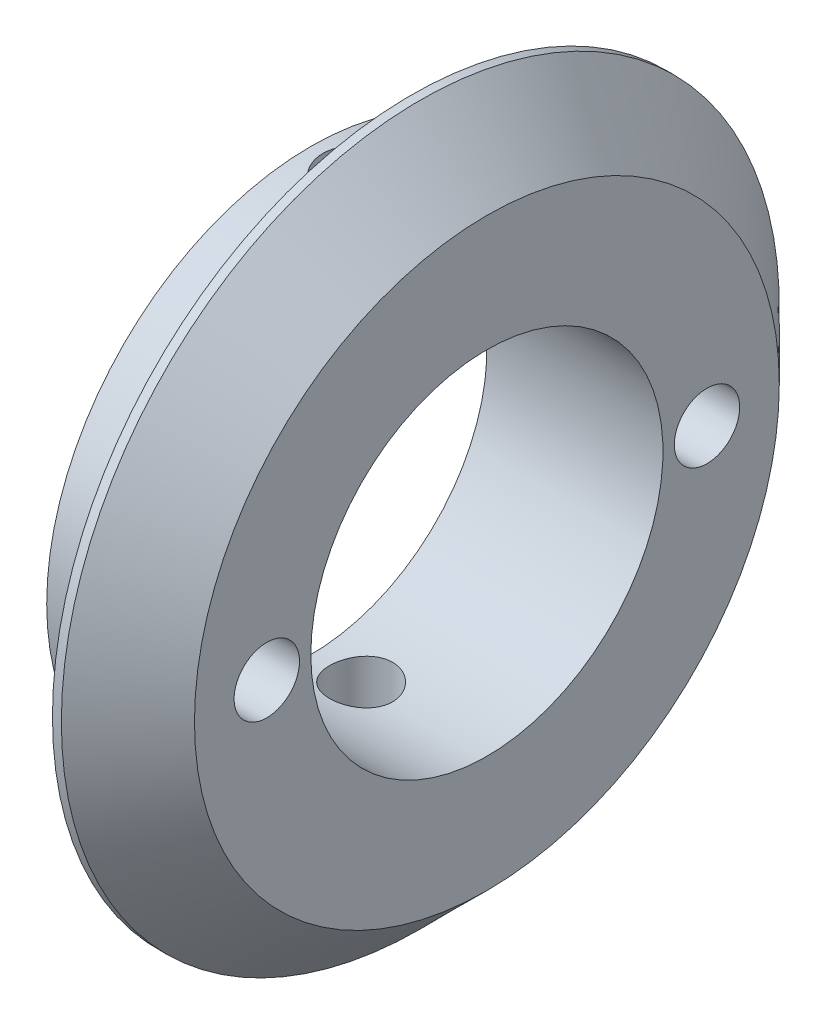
ISO-10303-21;
HEADER;
FILE_DESCRIPTION(('STEP AP214'),'2;1');
FILE_NAME('part.step','',(''),(''),'','','');
FILE_SCHEMA(('AUTOMOTIVE_DESIGN { 1 0 10303 214 1 1 1 1 }'));
ENDSEC;
DATA;
#1=APPLICATION_CONTEXT('core data for automotive mechanical design processes');
#2=APPLICATION_PROTOCOL_DEFINITION('international standard','automotive_design',2000,#1);
#3=PRODUCT_CONTEXT('',#1,'mechanical');
#4=PRODUCT('Part','Part','',(#3));
#5=PRODUCT_RELATED_PRODUCT_CATEGORY('part','',(#4));
#6=PRODUCT_DEFINITION_FORMATION('','',#4);
#7=PRODUCT_DEFINITION_CONTEXT('part definition',#1,'design');
#8=PRODUCT_DEFINITION('design','',#6,#7);
#9=PRODUCT_DEFINITION_SHAPE('','',#8);
#10=(LENGTH_UNIT() NAMED_UNIT(*) SI_UNIT(.MILLI.,.METRE.));
#11=(NAMED_UNIT(*) PLANE_ANGLE_UNIT() SI_UNIT($,.RADIAN.));
#12=(NAMED_UNIT(*) SI_UNIT($,.STERADIAN.) SOLID_ANGLE_UNIT());
#13=UNCERTAINTY_MEASURE_WITH_UNIT(LENGTH_MEASURE(1.E-05),#10,'distance_accuracy_value','');
#14=(GEOMETRIC_REPRESENTATION_CONTEXT(3) GLOBAL_UNCERTAINTY_ASSIGNED_CONTEXT((#13)) GLOBAL_UNIT_ASSIGNED_CONTEXT((#10,
#11,#12)) REPRESENTATION_CONTEXT('',''));
#15=CARTESIAN_POINT('',(0.,0.,0.));
#16=DIRECTION('',(0.,0.,1.));
#17=DIRECTION('',(1.,0.,0.));
#18=AXIS2_PLACEMENT_3D('',#15,#16,#17);
#19=CARTESIAN_POINT('',(3.9619976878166,20.,0.));
#20=DIRECTION('',(0.,1.,0.));
#21=DIRECTION('',(-1.,0.,0.));
#22=AXIS2_PLACEMENT_3D('',#19,#20,#21);
#23=CYLINDRICAL_SURFACE('',#22,3.);
#24=CARTESIAN_POINT('',(6.93633446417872,20.9963491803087,-0.39156184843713));
#25=CARTESIAN_POINT('',(6.9192450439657,20.9939283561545,-0.521374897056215));
#26=CARTESIAN_POINT('',(6.89364712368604,20.9903177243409,-0.650044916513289));
#27=CARTESIAN_POINT('',(6.82588533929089,20.9809611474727,-0.90293604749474));
#28=CARTESIAN_POINT('',(6.78371274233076,20.9752140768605,-1.02715477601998));
#29=CARTESIAN_POINT('',(6.68352675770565,20.961971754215,-1.26902565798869));
#30=CARTESIAN_POINT('',(6.62550292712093,20.9544753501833,-1.38667342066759));
#31=CARTESIAN_POINT('',(6.49460727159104,20.9382401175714,-1.61339170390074));
#32=CARTESIAN_POINT('',(6.42172693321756,20.9295005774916,-1.72245725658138));
#33=CARTESIAN_POINT('',(6.26236201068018,20.9113704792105,-1.93014581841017));
#34=CARTESIAN_POINT('',(6.1758729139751,20.9019797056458,-2.02876534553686));
#35=CARTESIAN_POINT('',(5.99076378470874,20.8831851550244,-2.21387464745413));
#36=CARTESIAN_POINT('',(5.89214358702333,20.8737813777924,-2.30036425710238));
#37=CARTESIAN_POINT('',(5.68445450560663,20.8556028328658,-2.45972958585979));
#38=CARTESIAN_POINT('',(5.57538906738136,20.8468278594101,-2.53260977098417));
#39=CARTESIAN_POINT('',(5.34867109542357,20.830508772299,-2.66350524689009));
#40=CARTESIAN_POINT('',(5.2310235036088,20.8229639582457,-2.72152900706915));
#41=CARTESIAN_POINT('',(4.98915286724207,20.8096248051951,-2.8217148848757));
#42=CARTESIAN_POINT('',(4.86493424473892,20.8038293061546,-2.86388751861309));
#43=CARTESIAN_POINT('',(4.61204303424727,20.7943888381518,-2.9316493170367));
#44=CARTESIAN_POINT('',(4.48337286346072,20.7907427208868,-2.95724733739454));
#45=CARTESIAN_POINT('',(4.2238003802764,20.7858536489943,-2.99141907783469));
#46=CARTESIAN_POINT('',(4.09289903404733,20.7846096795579,-2.9999999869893));
#47=CARTESIAN_POINT('',(3.83109634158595,20.7846096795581,-2.99999998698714));
#48=CARTESIAN_POINT('',(3.70019499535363,20.7858536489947,-2.99141907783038));
#49=CARTESIAN_POINT('',(3.44062251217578,20.7907427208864,-2.95724733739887));
#50=CARTESIAN_POINT('',(3.31195234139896,20.7943888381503,-2.93164931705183));
#51=CARTESIAN_POINT('',(3.05906113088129,20.8038293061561,-2.86388751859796));
#52=CARTESIAN_POINT('',(2.93484250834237,20.8096248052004,-2.8217148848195));
#53=CARTESIAN_POINT('',(2.69297187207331,20.8229639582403,-2.72152900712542));
#54=CARTESIAN_POINT('',(2.57532428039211,20.8305087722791,-2.66350524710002));
#55=CARTESIAN_POINT('',(2.34860630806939,20.84682785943,-2.53260977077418));
#56=CARTESIAN_POINT('',(2.23954086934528,20.8556028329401,-2.45972958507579));
#57=CARTESIAN_POINT('',(2.03185250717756,20.8737813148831,-2.30036480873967));
#58=CARTESIAN_POINT('',(1.93323295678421,20.88318502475,-2.21387584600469));
#59=CARTESIAN_POINT('',(1.74812366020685,20.9019795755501,-2.0287667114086));
#60=CARTESIAN_POINT('',(1.66163391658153,20.9113704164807,-1.93014653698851));
#61=CARTESIAN_POINT('',(1.50226844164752,20.929500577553,-1.72245725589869));
#62=CARTESIAN_POINT('',(1.42938810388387,20.9382401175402,-1.61339170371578));
#63=CARTESIAN_POINT('',(1.29849244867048,20.9544753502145,-1.38667342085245));
#64=CARTESIAN_POINT('',(1.24046861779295,20.9619717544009,-1.26902565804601));
#65=CARTESIAN_POINT('',(1.14028263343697,20.9752140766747,-1.02715477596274));
#66=CARTESIAN_POINT('',(1.09811003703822,20.9809611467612,-0.902936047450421));
#67=CARTESIAN_POINT('',(1.03034825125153,20.9903177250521,-0.650044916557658));
#68=CARTESIAN_POINT('',(1.00475032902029,20.9939283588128,-0.521374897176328));
#69=CARTESIAN_POINT('',(0.97057857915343,20.9987689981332,-0.261802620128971));
#70=CARTESIAN_POINT('',(0.961997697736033,20.9999999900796,-0.130901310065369));
#71=CARTESIAN_POINT('',(0.96199769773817,20.9999999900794,0.130901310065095));
#72=CARTESIAN_POINT('',(0.970578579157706,20.9987689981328,0.261802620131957));
#73=CARTESIAN_POINT('',(1.00475032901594,20.9939283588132,0.521374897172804));
#74=CARTESIAN_POINT('',(1.03034825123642,20.9903177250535,0.650044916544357));
#75=CARTESIAN_POINT('',(1.09811003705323,20.9809611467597,0.902936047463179));
#76=CARTESIAN_POINT('',(1.14028263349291,20.9752140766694,1.02715477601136));
#77=CARTESIAN_POINT('',(1.24046861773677,20.9619717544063,1.26902565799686));
#78=CARTESIAN_POINT('',(1.29849244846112,20.9544753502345,1.38667342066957));
#79=CARTESIAN_POINT('',(1.42938810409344,20.9382401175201,1.61339170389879));
#80=CARTESIAN_POINT('',(1.50226844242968,20.929500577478,1.72245725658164));
#81=CARTESIAN_POINT('',(1.66163336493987,20.9113704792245,1.93014581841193));
#82=CARTESIAN_POINT('',(1.74812246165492,20.9019797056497,2.02876534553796));
#83=CARTESIAN_POINT('',(1.93323159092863,20.8831851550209,2.21387464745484));
#84=CARTESIAN_POINT('',(2.03185178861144,20.8737813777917,2.30036425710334));
#85=CARTESIAN_POINT('',(2.23954087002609,20.855602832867,2.45972958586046));
#86=CARTESIAN_POINT('',(2.34860630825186,20.8468278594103,2.53260977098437));
#87=CARTESIAN_POINT('',(2.57532428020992,20.8305087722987,2.66350524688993));
#88=CARTESIAN_POINT('',(2.69297187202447,20.8229639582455,2.72152900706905));
#89=CARTESIAN_POINT('',(2.93484250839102,20.8096248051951,2.82171488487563));
#90=CARTESIAN_POINT('',(3.05906113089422,20.8038293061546,2.86388751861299));
#91=CARTESIAN_POINT('',(3.31195234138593,20.7943888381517,2.93164931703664));
#92=CARTESIAN_POINT('',(3.44062251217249,20.7907427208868,2.95724733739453));
#93=CARTESIAN_POINT('',(3.70019499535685,20.7858536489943,2.99141907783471));
#94=CARTESIAN_POINT('',(3.83109634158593,20.7846096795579,2.9999999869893));
#95=CARTESIAN_POINT('',(4.09289903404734,20.7846096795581,2.99999998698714));
#96=CARTESIAN_POINT('',(4.22380038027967,20.7858536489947,2.99141907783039));
#97=CARTESIAN_POINT('',(4.48337286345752,20.7907427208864,2.95724733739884));
#98=CARTESIAN_POINT('',(4.61204303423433,20.7943888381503,2.93164931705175));
#99=CARTESIAN_POINT('',(4.86493424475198,20.803829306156,2.86388751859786));
#100=CARTESIAN_POINT('',(4.98915286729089,20.8096248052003,2.82171488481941));
#101=CARTESIAN_POINT('',(5.2310235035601,20.8229639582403,2.72152900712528));
#102=CARTESIAN_POINT('',(5.34867109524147,20.8305087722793,2.66350524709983));
#103=CARTESIAN_POINT('',(5.57538906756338,20.8468278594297,2.5326097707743));
#104=CARTESIAN_POINT('',(5.68445450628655,20.8556028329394,2.45972958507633));
#105=CARTESIAN_POINT('',(5.8921428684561,20.8737813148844,2.30036480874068));
#106=CARTESIAN_POINT('',(5.99076241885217,20.8831850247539,2.21387584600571));
#107=CARTESIAN_POINT('',(6.17587171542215,20.9019795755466,2.02876671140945));
#108=CARTESIAN_POINT('',(6.26236145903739,20.9113704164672,1.9301465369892));
#109=CARTESIAN_POINT('',(6.42172693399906,20.9295005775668,1.72245725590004));
#110=CARTESIAN_POINT('',(6.49460727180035,20.9382401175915,1.61339170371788));
#111=CARTESIAN_POINT('',(6.62550292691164,20.9544753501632,1.38667342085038));
#112=CARTESIAN_POINT('',(6.68352675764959,20.9619717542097,1.26902565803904));
#113=CARTESIAN_POINT('',(6.78371274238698,20.9752140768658,1.02715477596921));
#114=CARTESIAN_POINT('',(6.82588533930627,20.980961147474,0.902936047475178));
#115=CARTESIAN_POINT('',(6.89364712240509,20.9903177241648,0.650044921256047));
#116=CARTESIAN_POINT('',(6.9192450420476,20.9939283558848,0.521374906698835));
#117=CARTESIAN_POINT('',(6.95341679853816,20.9987690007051,0.261802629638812));
#118=CARTESIAN_POINT('',(6.96199768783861,21.0000000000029,0.13090131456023));
#119=CARTESIAN_POINT('',(6.96199768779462,20.9999999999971,-0.130901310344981));
#120=CARTESIAN_POINT('',(6.95341679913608,20.9987690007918,-0.26180262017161));
#121=CARTESIAN_POINT('',(6.93633446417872,20.9963491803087,-0.39156184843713));
#122=B_SPLINE_CURVE_WITH_KNOTS('',3,(#24,#25,#26,#27,#28,#29,#30,#31,#32,#33,#34,#35,#36,#37,
#38,#39,#40,#41,#42,#43,#44,#45,#46,#47,#48,#49,#50,#51,#52,#53,#54,#55,#56,#57,#58,#59,#60,#61,
#62,#63,#64,#65,#66,#67,#68,#69,#70,#71,#72,#73,#74,#75,#76,#77,#78,#79,#80,#81,#82,#83,#84,#85,
#86,#87,#88,#89,#90,#91,#92,#93,#94,#95,#96,#97,#98,#99,#100,#101,#102,#103,#104,#105,#106,#107,
#108,#109,#110,#111,#112,#113,#114,#115,#116,#117,#118,#119,#120,#121),.UNSPECIFIED.,.T.,.F.,(4,
2,2,2,2,2,2,2,2,2,2,2,2,2,2,2,2,2,2,2,2,2,2,2,2,2,2,2,2,2,2,2,2,2,2,2,2,2,2,2,2,2,2,2,2,2,2,2,
4),(0.,0.392581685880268,0.785370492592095,1.1784186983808,1.57169277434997,1.96509753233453,
2.35850764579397,2.7517884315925,3.14484451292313,3.53763936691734,3.93022418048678,
4.32264310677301,4.71506203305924,5.10764684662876,5.50044170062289,5.89349778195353,
6.28677856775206,6.68018596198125,7.07359343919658,7.46686751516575,7.85991572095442,
8.25270452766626,8.64528621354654,9.03770513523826,9.43012405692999,9.82270574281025,
10.2154945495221,10.6085427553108,11.0018168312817,11.3952215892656,11.7886317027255,
12.1819124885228,12.5749685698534,12.9677634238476,13.3603482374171,13.7527671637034,
14.1451860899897,14.5377709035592,14.9305657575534,15.323621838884,15.7169026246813,
16.1103100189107,16.5037174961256,16.8969915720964,17.2900397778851,17.682828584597,
18.0754102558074,18.467829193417,18.8602481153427),.UNSPECIFIED.);
#123=CARTESIAN_POINT('',(6.93633446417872,20.9963491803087,-0.39156184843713));
#124=VERTEX_POINT('',#123);
#125=EDGE_CURVE('E71',#124,#124,#122,.T.);
#126=ORIENTED_EDGE('',*,*,#125,.T.);
#127=EDGE_LOOP('',(#126));
#128=FACE_BOUND('',#127,.T.);
#129=CARTESIAN_POINT('',(3.9619976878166,20.,0.));
#130=DIRECTION('',(0.,1.,0.));
#131=DIRECTION('',(-1.,0.,0.));
#132=AXIS2_PLACEMENT_3D('',#129,#130,#131);
#133=CIRCLE('',#132,3.);
#134=CARTESIAN_POINT('',(0.961997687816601,20.,0.));
#135=VERTEX_POINT('',#134);
#136=EDGE_CURVE('E19',#135,#135,#133,.F.);
#137=ORIENTED_EDGE('',*,*,#136,.T.);
#138=EDGE_LOOP('',(#137));
#139=FACE_BOUND('',#138,.T.);
#140=ADVANCED_FACE('F15',(#128,#139),#23,.F.);
#141=CARTESIAN_POINT('',(0.90199768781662,20.,3.));
#142=DIRECTION('',(0.,-1.,0.));
#143=DIRECTION('',(0.,0.,-1.));
#144=AXIS2_PLACEMENT_3D('',#141,#142,#143);
#145=PLANE('',#144);
#146=CARTESIAN_POINT('',(4.,20.,0.));
#147=DIRECTION('',(0.,1.,0.));
#148=DIRECTION('',(0.,0.,1.));
#149=AXIS2_PLACEMENT_3D('',#146,#147,#148);
#150=CIRCLE('',#149,2.5);
#151=CARTESIAN_POINT('',(4.,20.,2.5));
#152=VERTEX_POINT('',#151);
#153=EDGE_CURVE('E157',#152,#152,#150,.T.);
#154=ORIENTED_EDGE('',*,*,#153,.F.);
#155=EDGE_LOOP('',(#154));
#156=FACE_BOUND('',#155,.T.);
#157=ORIENTED_EDGE('',*,*,#136,.F.);
#158=EDGE_LOOP('',(#157));
#159=FACE_BOUND('',#158,.T.);
#160=ADVANCED_FACE('F48',(#156,#159),#145,.F.);
#161=CARTESIAN_POINT('',(4.,13.7376271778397,0.));
#162=DIRECTION('',(0.,1.,0.));
#163=DIRECTION('',(0.,0.,1.));
#164=AXIS2_PLACEMENT_3D('',#161,#162,#163);
#165=CYLINDRICAL_SURFACE('',#164,2.5);
#166=ORIENTED_EDGE('',*,*,#153,.T.);
#167=EDGE_LOOP('',(#166));
#168=FACE_BOUND('',#167,.T.);
#169=CARTESIAN_POINT('',(4.00000016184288,13.7749773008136,2.49999998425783));
#170=CARTESIAN_POINT('',(4.10908546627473,13.7749773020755,2.49999997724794));
#171=CARTESIAN_POINT('',(4.21817076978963,13.7762809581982,2.49284860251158));
#172=CARTESIAN_POINT('',(4.43448750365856,13.781403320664,2.46437210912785));
#173=CARTESIAN_POINT('',(4.54171764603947,13.7852237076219,2.44303751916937));
#174=CARTESIAN_POINT('',(4.75246644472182,13.7951119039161,2.38656780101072));
#175=CARTESIAN_POINT('',(4.85598189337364,13.8011816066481,2.35142104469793));
#176=CARTESIAN_POINT('',(5.05754062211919,13.8151463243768,2.26793297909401));
#177=CARTESIAN_POINT('',(5.15557806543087,13.823043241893,2.21957790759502));
#178=CARTESIAN_POINT('',(5.34450646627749,13.8401167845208,2.11050030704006));
#179=CARTESIAN_POINT('',(5.43539094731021,13.8492945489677,2.04976674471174));
#180=CARTESIAN_POINT('',(5.60845991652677,13.8682996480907,1.91696641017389));
#181=CARTESIAN_POINT('',(5.69063998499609,13.8781273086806,1.84489392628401));
#182=CARTESIAN_POINT('',(5.84489264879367,13.897761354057,1.6906412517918));
#183=CARTESIAN_POINT('',(5.91696541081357,13.9075677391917,1.60846122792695));
#184=CARTESIAN_POINT('',(6.04976604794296,13.9264933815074,1.43539184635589));
#185=CARTESIAN_POINT('',(6.11049992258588,13.9356130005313,1.34450713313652));
#186=CARTESIAN_POINT('',(6.21957789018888,13.9525488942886,1.15557809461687));
#187=CARTESIAN_POINT('',(6.26793310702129,13.9603663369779,1.05754029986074));
#188=CARTESIAN_POINT('',(6.35142139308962,13.9741720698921,0.855981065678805));
#189=CARTESIAN_POINT('',(6.38656807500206,13.9801622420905,0.752465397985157));
#190=CARTESIAN_POINT('',(6.44303776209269,13.989912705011,0.541716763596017));
#191=CARTESIAN_POINT('',(6.46437214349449,13.9936748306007,0.434486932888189));
#192=CARTESIAN_POINT('',(6.49284866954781,13.9987176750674,0.218170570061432));
#193=CARTESIAN_POINT('',(6.49999999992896,13.9999999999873,0.109085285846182));
#194=CARTESIAN_POINT('',(6.50000000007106,14.0000000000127,-0.10908528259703));
#195=CARTESIAN_POINT('',(6.4928486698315,13.9987176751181,-0.218170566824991));
#196=CARTESIAN_POINT('',(6.46437214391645,13.993674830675,-0.434486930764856));
#197=CARTESIAN_POINT('',(6.44303776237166,13.9899127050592,-0.541716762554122));
#198=CARTESIAN_POINT('',(6.38656807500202,13.9801622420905,-0.752465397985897));
#199=CARTESIAN_POINT('',(6.35142139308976,13.9741720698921,-0.855981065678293));
#200=CARTESIAN_POINT('',(6.26793310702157,13.9603663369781,-1.05754029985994));
#201=CARTESIAN_POINT('',(6.21957789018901,13.952548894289,-1.15557809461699));
#202=CARTESIAN_POINT('',(6.1104999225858,13.935613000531,-1.34450713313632));
#203=CARTESIAN_POINT('',(6.04976604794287,13.9264933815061,-1.43539184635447));
#204=CARTESIAN_POINT('',(5.91696541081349,13.907567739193,-1.6084612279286));
#205=CARTESIAN_POINT('',(5.8448926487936,13.8977613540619,-1.69064125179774));
#206=CARTESIAN_POINT('',(5.69063998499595,13.8781273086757,-1.84489392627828));
#207=CARTESIAN_POINT('',(5.60845991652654,13.8682996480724,-1.91696641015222));
#208=CARTESIAN_POINT('',(5.43539094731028,13.849294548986,-2.04976674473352));
#209=CARTESIAN_POINT('',(5.34450646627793,13.840116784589,-2.1105003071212));
#210=CARTESIAN_POINT('',(5.15557806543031,13.8230432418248,-2.21957790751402));
#211=CARTESIAN_POINT('',(5.05754062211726,13.8151463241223,-2.26793297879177));
#212=CARTESIAN_POINT('',(4.85598189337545,13.8011816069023,-2.35142104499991));
#213=CARTESIAN_POINT('',(4.75246644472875,13.7951119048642,-2.38656780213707));
#214=CARTESIAN_POINT('',(4.54171764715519,13.7852237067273,-2.44303751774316));
#215=CARTESIAN_POINT('',(4.4344875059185,13.7814033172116,-2.46437210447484));
#216=CARTESIAN_POINT('',(4.2181707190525,13.7762809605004,-2.49284861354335));
#217=CARTESIAN_POINT('',(4.1090853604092,13.7749773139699,-2.49999999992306));
#218=CARTESIAN_POINT('',(3.8909146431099,13.7749773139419,-2.50000000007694));
#219=CARTESIAN_POINT('',(3.7818292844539,13.7762809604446,-2.49284861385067));
#220=CARTESIAN_POINT('',(3.56551249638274,13.7814033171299,-2.46437210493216));
#221=CARTESIAN_POINT('',(3.45828235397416,13.7852237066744,-2.44303751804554));
#222=CARTESIAN_POINT('',(3.2475335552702,13.7951119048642,-2.38656780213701));
#223=CARTESIAN_POINT('',(3.14401810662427,13.8011816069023,-2.3514210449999));
#224=CARTESIAN_POINT('',(2.94245937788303,13.8151463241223,-2.26793297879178));
#225=CARTESIAN_POINT('',(2.84442193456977,13.8230432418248,-2.21957790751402));
#226=CARTESIAN_POINT('',(2.65549353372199,13.840116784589,-2.1105003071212));
#227=CARTESIAN_POINT('',(2.5646090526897,13.849294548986,-2.04976674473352));
#228=CARTESIAN_POINT('',(2.39154008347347,13.8682996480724,-1.91696641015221));
#229=CARTESIAN_POINT('',(2.30936001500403,13.8781273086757,-1.84489392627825));
#230=CARTESIAN_POINT('',(2.1551073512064,13.8977613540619,-1.69064125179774));
#231=CARTESIAN_POINT('',(2.08303458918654,13.907567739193,-1.60846122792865));
#232=CARTESIAN_POINT('',(1.95023395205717,13.9264933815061,-1.43539184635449));
#233=CARTESIAN_POINT('',(1.88950007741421,13.935613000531,-1.34450713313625));
#234=CARTESIAN_POINT('',(1.78042210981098,13.952548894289,-1.15557809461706));
#235=CARTESIAN_POINT('',(1.73206689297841,13.9603663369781,-1.05754029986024));
#236=CARTESIAN_POINT('',(1.64857860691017,13.9741720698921,-0.855981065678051));
#237=CARTESIAN_POINT('',(1.61343192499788,13.9801622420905,-0.752465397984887));
#238=CARTESIAN_POINT('',(1.55696223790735,13.9899127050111,-0.541716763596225));
#239=CARTESIAN_POINT('',(1.53562785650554,13.9936748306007,-0.434486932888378));
#240=CARTESIAN_POINT('',(1.50715133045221,13.9987176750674,-0.218170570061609));
#241=CARTESIAN_POINT('',(1.50000000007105,13.9999999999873,-0.109085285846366));
#242=CARTESIAN_POINT('',(1.49999999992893,14.0000000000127,0.109085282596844));
#243=CARTESIAN_POINT('',(1.50715133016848,13.9987176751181,0.218170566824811));
#244=CARTESIAN_POINT('',(1.53562785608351,13.993674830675,0.434486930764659));
#245=CARTESIAN_POINT('',(1.5569622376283,13.9899127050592,0.541716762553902));
#246=CARTESIAN_POINT('',(1.61343192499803,13.9801622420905,0.752465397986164));
#247=CARTESIAN_POINT('',(1.64857860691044,13.9741720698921,0.855981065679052));
#248=CARTESIAN_POINT('',(1.73206689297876,13.9603663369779,1.05754029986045));
#249=CARTESIAN_POINT('',(1.7804221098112,13.9525488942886,1.15557809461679));
#250=CARTESIAN_POINT('',(1.88950007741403,13.9356130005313,1.34450713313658));
#251=CARTESIAN_POINT('',(1.95023395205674,13.9264933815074,1.43539184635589));
#252=CARTESIAN_POINT('',(2.0830345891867,13.9075677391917,1.60846122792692));
#253=CARTESIAN_POINT('',(2.15510735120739,13.897761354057,1.6906412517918));
#254=CARTESIAN_POINT('',(2.30936001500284,13.8781273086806,1.84489392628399));
#255=CARTESIAN_POINT('',(2.39154008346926,13.8682996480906,1.91696641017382));
#256=CARTESIAN_POINT('',(2.56460905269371,13.8492945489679,2.04976674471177));
#257=CARTESIAN_POINT('',(2.65549353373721,13.8401167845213,2.11050030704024));
#258=CARTESIAN_POINT('',(2.84442193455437,13.8230432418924,2.2195779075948));
#259=CARTESIAN_POINT('',(2.94245937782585,13.8151463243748,2.26793297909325));
#260=CARTESIAN_POINT('',(3.1440181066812,13.8011816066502,2.35142104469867));
#261=CARTESIAN_POINT('',(3.24753355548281,13.7951119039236,2.3865678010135));
#262=CARTESIAN_POINT('',(3.45828222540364,13.7852237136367,2.44303748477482));
#263=CARTESIAN_POINT('',(3.56551223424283,13.781403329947,2.46437205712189));
#264=CARTESIAN_POINT('',(3.78182907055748,13.776280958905,2.49284859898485));
#265=CARTESIAN_POINT('',(3.89091461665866,13.7749772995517,2.49999999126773));
#266=CARTESIAN_POINT('',(4.00000016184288,13.7749773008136,2.49999998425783));
#267=B_SPLINE_CURVE_WITH_KNOTS('',3,(#169,#170,#171,#172,#173,#174,#175,#176,#177,#178,#179,
#180,#181,#182,#183,#184,#185,#186,#187,#188,#189,#190,#191,#192,#193,#194,#195,#196,#197,#198,
#199,#200,#201,#202,#203,#204,#205,#206,#207,#208,#209,#210,#211,#212,#213,#214,#215,#216,#217,
#218,#219,#220,#221,#222,#223,#224,#225,#226,#227,#228,#229,#230,#231,#232,#233,#234,#235,#236,
#237,#238,#239,#240,#241,#242,#243,#244,#245,#246,#247,#248,#249,#250,#251,#252,#253,#254,#255,
#256,#257,#258,#259,#260,#261,#262,#263,#264,#265,#266),.UNSPECIFIED.,.T.,.F.,(4,2,2,2,2,2,2,2,
2,2,2,2,2,2,2,2,2,2,2,2,2,2,2,2,2,2,2,2,2,2,2,2,2,2,2,2,2,2,2,2,2,2,2,2,2,2,2,2,4),(0.,
0.327015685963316,0.654249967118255,0.981760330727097,1.30961324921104,1.63775967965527,
1.96607193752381,2.29437878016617,2.62251141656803,2.95034813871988,3.27784606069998,
3.60507390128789,3.93208974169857,4.25910558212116,4.58633342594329,4.91383134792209,
5.24166807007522,5.56980070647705,5.89810754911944,6.22641980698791,6.55456623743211,
6.88241915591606,7.20992951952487,7.53716379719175,7.86417964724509,8.19119549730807,
8.51842977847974,8.8459401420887,9.17379306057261,9.50193949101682,9.83025174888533,
10.1585585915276,10.4866912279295,10.8145279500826,11.1420258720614,11.4692537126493,
11.79626955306,12.1232853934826,12.4505132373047,12.7780111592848,13.1058478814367,
13.4339805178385,13.7622873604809,14.0905996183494,14.4187460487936,14.7465989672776,
15.0741093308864,15.4013432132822,15.7283596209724),.UNSPECIFIED.);
#268=CARTESIAN_POINT('',(4.00000016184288,13.7749773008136,2.49999998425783));
#269=VERTEX_POINT('',#268);
#270=EDGE_CURVE('E10',#269,#269,#267,.T.);
#271=ORIENTED_EDGE('',*,*,#270,.F.);
#272=EDGE_LOOP('',(#271));
#273=FACE_BOUND('',#272,.T.);
#274=ADVANCED_FACE('F42',(#168,#273),#165,.F.);
#275=CARTESIAN_POINT('',(8.,28.542893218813,-28.542893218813));
#276=DIRECTION('',(-1.,0.,0.));
#277=DIRECTION('',(0.,-1.,0.));
#278=AXIS2_PLACEMENT_3D('',#275,#276,#277);
#279=PLANE('',#278);
#280=CARTESIAN_POINT('',(8.,0.,0.));
#281=DIRECTION('',(-1.,0.,0.));
#282=DIRECTION('',(0.,0.,1.));
#283=AXIS2_PLACEMENT_3D('',#280,#281,#282);
#284=CIRCLE('',#283,21.);
#285=CARTESIAN_POINT('',(8.,0.,21.));
#286=VERTEX_POINT('',#285);
#287=EDGE_CURVE('E156',#286,#286,#284,.F.);
#288=ORIENTED_EDGE('',*,*,#287,.T.);
#289=EDGE_LOOP('',(#288));
#290=FACE_BOUND('',#289,.T.);
#291=CARTESIAN_POINT('',(8.,0.,0.));
#292=DIRECTION('',(-1.,0.,0.));
#293=DIRECTION('',(0.,0.,1.));
#294=AXIS2_PLACEMENT_3D('',#291,#292,#293);
#295=CIRCLE('',#294,28.542893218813);
#296=CARTESIAN_POINT('',(8.,0.,28.542893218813));
#297=VERTEX_POINT('',#296);
#298=EDGE_CURVE('E154',#297,#297,#295,.T.);
#299=ORIENTED_EDGE('',*,*,#298,.T.);
#300=EDGE_LOOP('',(#299));
#301=FACE_BOUND('',#300,.T.);
#302=ADVANCED_FACE('F47',(#290,#301),#279,.T.);
#303=CARTESIAN_POINT('',(8.7071067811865,0.,0.));
#304=DIRECTION('',(-1.,0.,0.));
#305=DIRECTION('',(0.,0.,1.));
#306=AXIS2_PLACEMENT_3D('',#303,#304,#305);
#307=CYLINDRICAL_SURFACE('',#306,28.542893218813);
#308=CARTESIAN_POINT('',(8.7071067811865,0.,0.));
#309=DIRECTION('',(-1.,0.,0.));
#310=DIRECTION('',(0.,-1.,0.));
#311=AXIS2_PLACEMENT_3D('',#308,#309,#310);
#312=CIRCLE('',#311,28.542893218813);
#313=CARTESIAN_POINT('',(8.7071067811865,-28.542893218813,0.));
#314=VERTEX_POINT('',#313);
#315=EDGE_CURVE('E76',#314,#314,#312,.T.);
#316=ORIENTED_EDGE('',*,*,#315,.T.);
#317=EDGE_LOOP('',(#316));
#318=FACE_BOUND('',#317,.T.);
#319=ORIENTED_EDGE('',*,*,#298,.F.);
#320=EDGE_LOOP('',(#319));
#321=FACE_BOUND('',#320,.T.);
#322=ADVANCED_FACE('F51',(#318,#321),#307,.T.);
#323=CARTESIAN_POINT('',(1.,-2.6,20.1));
#324=DIRECTION('',(-1.,0.,0.));
#325=DIRECTION('',(0.,1.,0.));
#326=AXIS2_PLACEMENT_3D('',#323,#324,#325);
#327=PLANE('',#326);
#328=CARTESIAN_POINT('',(1.,0.,17.5));
#329=DIRECTION('',(1.,0.,0.));
#330=DIRECTION('',(0.,0.,-1.));
#331=AXIS2_PLACEMENT_3D('',#328,#329,#330);
#332=CIRCLE('',#331,2.6);
#333=CARTESIAN_POINT('',(1.,0.,14.9));
#334=VERTEX_POINT('',#333);
#335=EDGE_CURVE('E79',#334,#334,#332,.F.);
#336=ORIENTED_EDGE('',*,*,#335,.F.);
#337=EDGE_LOOP('',(#336));
#338=FACE_BOUND('',#337,.T.);
#339=ADVANCED_FACE('F54',(#338),#327,.F.);
#340=CARTESIAN_POINT('',(1.,-2.6,-14.9));
#341=DIRECTION('',(-1.,0.,0.));
#342=DIRECTION('',(0.,1.,0.));
#343=AXIS2_PLACEMENT_3D('',#340,#341,#342);
#344=PLANE('',#343);
#345=CARTESIAN_POINT('',(1.,0.,-17.5));
#346=DIRECTION('',(1.,0.,0.));
#347=DIRECTION('',(0.,0.,-1.));
#348=AXIS2_PLACEMENT_3D('',#345,#346,#347);
#349=CIRCLE('',#348,2.6);
#350=CARTESIAN_POINT('',(1.,0.,-20.1));
#351=VERTEX_POINT('',#350);
#352=EDGE_CURVE('E82',#351,#351,#349,.F.);
#353=ORIENTED_EDGE('',*,*,#352,.F.);
#354=EDGE_LOOP('',(#353));
#355=FACE_BOUND('',#354,.T.);
#356=ADVANCED_FACE('F61',(#355),#344,.F.);
#357=CARTESIAN_POINT('',(8.,0.,0.));
#358=DIRECTION('',(-1.,0.,0.));
#359=DIRECTION('',(0.,0.,1.));
#360=AXIS2_PLACEMENT_3D('',#357,#358,#359);
#361=CYLINDRICAL_SURFACE('',#360,21.);
#362=CARTESIAN_POINT('',(1.52138657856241,-20.9974647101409,-0.326305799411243));
#363=CARTESIAN_POINT('',(1.53562682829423,-20.9957837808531,-0.434474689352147));
#364=CARTESIAN_POINT('',(1.55695689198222,-20.993276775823,-0.54169696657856));
#365=CARTESIAN_POINT('',(1.61342414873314,-20.9867806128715,-0.752436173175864));
#366=CARTESIAN_POINT('',(1.64856640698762,-20.9827909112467,-0.85595172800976));
#367=CARTESIAN_POINT('',(1.73205468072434,-20.9735990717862,-1.05751066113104));
#368=CARTESIAN_POINT('',(1.78040673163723,-20.9683963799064,-1.15555151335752));
#369=CARTESIAN_POINT('',(1.88948723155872,-20.9571306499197,-1.34448478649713));
#370=CARTESIAN_POINT('',(1.95022058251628,-20.9510672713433,-1.4353743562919));
#371=CARTESIAN_POINT('',(2.08302696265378,-20.9384913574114,-1.60845129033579));
#372=CARTESIAN_POINT('',(2.15510268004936,-20.9319787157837,-1.69063658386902));
#373=CARTESIAN_POINT('',(2.30936305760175,-20.9189472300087,-1.84489696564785));
#374=CARTESIAN_POINT('',(2.39154767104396,-20.9124283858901,-1.91697210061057));
#375=CARTESIAN_POINT('',(2.56462403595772,-20.8998292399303,-2.04977832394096));
#376=CARTESIAN_POINT('',(2.6555138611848,-20.8937488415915,-2.11051191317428));
#377=CARTESIAN_POINT('',(2.84444740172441,-20.8824428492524,-2.21959271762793));
#378=CARTESIAN_POINT('',(2.94248825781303,-20.8772169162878,-2.2679448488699));
#379=CARTESIAN_POINT('',(3.14406454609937,-20.8679777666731,-2.35144035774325));
#380=CARTESIAN_POINT('',(3.24759838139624,-20.8639641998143,-2.38658755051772));
#381=CARTESIAN_POINT('',(3.45832844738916,-20.85742857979,-2.44304735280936));
#382=CARTESIAN_POINT('',(3.56552163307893,-20.8549053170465,-2.46437118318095));
#383=CARTESIAN_POINT('',(3.78180966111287,-20.8515206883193,-2.4928480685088));
#384=CARTESIAN_POINT('',(3.89090465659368,-20.8506594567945,-2.49999997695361));
#385=CARTESIAN_POINT('',(4.10909464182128,-20.850659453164,-2.50000000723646));
#386=CARTESIAN_POINT('',(4.21818963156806,-20.8515206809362,-2.49284813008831));
#387=CARTESIAN_POINT('',(4.43447763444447,-20.8549053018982,-2.46437131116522));
#388=CARTESIAN_POINT('',(4.54167080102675,-20.8574285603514,-2.44304751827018));
#389=CARTESIAN_POINT('',(4.7524008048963,-20.8639641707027,-2.38658780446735));
#390=CARTESIAN_POINT('',(4.85593459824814,-20.8679777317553,-2.35144066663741));
#391=CARTESIAN_POINT('',(5.0575107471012,-20.8772168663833,-2.2679453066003));
#392=CARTESIAN_POINT('',(5.15555150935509,-20.8824427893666,-2.21959327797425));
#393=CARTESIAN_POINT('',(5.3444846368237,-20.893748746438,-2.11051284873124));
#394=CARTESIAN_POINT('',(5.43537416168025,-20.8998291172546,-2.04977956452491));
#395=CARTESIAN_POINT('',(5.60845102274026,-20.9124282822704,-1.91697324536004));
#396=CARTESIAN_POINT('',(5.69063633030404,-20.9189471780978,-1.84489757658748));
#397=CARTESIAN_POINT('',(5.84489672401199,-20.9319786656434,-1.69063718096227));
#398=CARTESIAN_POINT('',(5.91697192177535,-20.9384912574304,-1.60845256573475));
#399=CARTESIAN_POINT('',(6.04977820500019,-20.9510671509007,-1.43537611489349));
#400=CARTESIAN_POINT('',(6.11051184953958,-20.9571305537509,-1.34448625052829));
#401=CARTESIAN_POINT('',(6.21959271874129,-20.9683963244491,-1.1555525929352));
#402=CARTESIAN_POINT('',(6.2679448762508,-20.973599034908,-1.0575116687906));
#403=CARTESIAN_POINT('',(6.35144033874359,-20.9827916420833,-0.855935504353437));
#404=CARTESIAN_POINT('',(6.38658745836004,-20.9867818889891,-0.752401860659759));
#405=CARTESIAN_POINT('',(6.44304762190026,-20.9932772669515,-0.54167073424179));
#406=CARTESIAN_POINT('',(6.46437163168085,-20.995783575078,-0.434476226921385));
#407=CARTESIAN_POINT('',(6.49284824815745,-20.9991449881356,-0.218187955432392));
#408=CARTESIAN_POINT('',(6.49999997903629,-20.9999999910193,-0.109094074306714));
#409=CARTESIAN_POINT('',(6.50000001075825,-20.9999999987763,0.109083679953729));
#410=CARTESIAN_POINT('',(6.49284961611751,-20.9991451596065,0.21816755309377));
#411=CARTESIAN_POINT('',(6.4643732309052,-20.9957837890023,0.434474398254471));
#412=CARTESIAN_POINT('',(6.44304314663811,-20.9932767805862,0.541696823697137));
#413=CARTESIAN_POINT('',(6.3865758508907,-20.986780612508,0.752436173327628));
#414=CARTESIAN_POINT('',(6.35143359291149,-20.9827909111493,0.85595172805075));
#415=CARTESIAN_POINT('',(6.26794531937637,-20.9735990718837,1.05751066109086));
#416=CARTESIAN_POINT('',(6.21959326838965,-20.9683963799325,1.155551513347));
#417=CARTESIAN_POINT('',(6.1105127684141,-20.9571306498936,1.34448478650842));
#418=CARTESIAN_POINT('',(6.04977941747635,-20.9510672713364,1.43537435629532));
#419=CARTESIAN_POINT('',(5.91697303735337,-20.9384913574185,1.6084512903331));
#420=CARTESIAN_POINT('',(5.84489731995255,-20.9319787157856,1.69063658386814));
#421=CARTESIAN_POINT('',(5.69063694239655,-20.9189472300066,1.84489696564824));
#422=CARTESIAN_POINT('',(5.60845232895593,-20.9124283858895,1.91697210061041));
#423=CARTESIAN_POINT('',(5.43537596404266,-20.8998292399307,2.04977832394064));
#424=CARTESIAN_POINT('',(5.34448613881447,-20.8937488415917,2.11051191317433));
#425=CARTESIAN_POINT('',(5.15555259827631,-20.8824428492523,2.21959271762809));
#426=CARTESIAN_POINT('',(5.05751174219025,-20.8772169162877,2.26794484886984));
#427=CARTESIAN_POINT('',(4.85593545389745,-20.8679777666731,2.35144035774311));
#428=CARTESIAN_POINT('',(4.75240161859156,-20.8639641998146,2.38658755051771));
#429=CARTESIAN_POINT('',(4.54167155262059,-20.8574285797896,2.44304735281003));
#430=CARTESIAN_POINT('',(4.43447836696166,-20.8549053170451,2.46437118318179));
#431=CARTESIAN_POINT('',(4.21819027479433,-20.8515206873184,2.49284807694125));
#432=CARTESIAN_POINT('',(4.1090952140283,-20.8506594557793,2.49999998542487));
#433=CARTESIAN_POINT('',(3.89090513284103,-20.8506594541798,2.49999999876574));
#434=CARTESIAN_POINT('',(3.78181011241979,-20.8515206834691,2.49284810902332));
#435=CARTESIAN_POINT('',(3.56552217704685,-20.8549053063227,2.46437127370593));
#436=CARTESIAN_POINT('',(3.4583291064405,-20.8574285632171,2.44304749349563));
#437=CARTESIAN_POINT('',(3.24759919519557,-20.863964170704,2.38658780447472));
#438=CARTESIAN_POINT('',(3.14406540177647,-20.8679777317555,2.35144066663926));
#439=CARTESIAN_POINT('',(2.94248925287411,-20.877216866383,2.26794530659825));
#440=CARTESIAN_POINT('',(2.8444484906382,-20.8824427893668,2.21959327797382));
#441=CARTESIAN_POINT('',(2.65551536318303,-20.8937487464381,2.1105128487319));
#442=CARTESIAN_POINT('',(2.56462583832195,-20.899829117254,2.04977956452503));
#443=CARTESIAN_POINT('',(2.39154897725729,-20.9124282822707,1.91697324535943));
#444=CARTESIAN_POINT('',(2.30936366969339,-20.9189471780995,1.84489757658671));
#445=CARTESIAN_POINT('',(2.15510327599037,-20.9319786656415,1.69063718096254));
#446=CARTESIAN_POINT('',(2.08302807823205,-20.9384912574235,1.60845256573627));
#447=CARTESIAN_POINT('',(1.95022179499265,-20.9510671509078,1.43537611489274));
#448=CARTESIAN_POINT('',(1.88948815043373,-20.9571305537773,1.34448625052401));
#449=CARTESIAN_POINT('',(1.78040728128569,-20.9683963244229,1.15555259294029));
#450=CARTESIAN_POINT('',(1.73205512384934,-20.97359903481,1.05751166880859));
#451=CARTESIAN_POINT('',(1.64855966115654,-20.9827916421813,0.855935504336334));
#452=CARTESIAN_POINT('',(1.61341254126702,-20.9867818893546,0.752401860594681));
#453=CARTESIAN_POINT('',(1.55695239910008,-20.9932772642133,0.541670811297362));
#454=CARTESIAN_POINT('',(1.53562840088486,-20.9957835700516,0.434476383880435));
#455=CARTESIAN_POINT('',(1.50715176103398,-20.9991449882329,0.218188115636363));
#456=CARTESIAN_POINT('',(1.50000001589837,-20.9999999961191,0.10909415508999));
#457=CARTESIAN_POINT('',(1.49999998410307,-21.0000000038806,-0.109083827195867));
#458=CARTESIAN_POINT('',(1.50715040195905,-20.9991451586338,-0.218167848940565));
#459=CARTESIAN_POINT('',(1.52138657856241,-20.9974647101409,-0.326305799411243));
#460=B_SPLINE_CURVE_WITH_KNOTS('',3,(#362,#363,#364,#365,#366,#367,#368,#369,#370,#371,#372,
#373,#374,#375,#376,#377,#378,#379,#380,#381,#382,#383,#384,#385,#386,#387,#388,#389,#390,#391,
#392,#393,#394,#395,#396,#397,#398,#399,#400,#401,#402,#403,#404,#405,#406,#407,#408,#409,#410,
#411,#412,#413,#414,#415,#416,#417,#418,#419,#420,#421,#422,#423,#424,#425,#426,#427,#428,#429,
#430,#431,#432,#433,#434,#435,#436,#437,#438,#439,#440,#441,#442,#443,#444,#445,#446,#447,#448,
#449,#450,#451,#452,#453,#454,#455,#456,#457,#458,#459),.UNSPECIFIED.,.T.,.F.,(4,2,2,2,2,2,2,2,
2,2,2,2,2,2,2,2,2,2,2,2,2,2,2,2,2,2,2,2,2,2,2,2,2,2,2,2,2,2,2,2,2,2,2,2,2,2,2,2,4),(0.,
0.327109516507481,0.654339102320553,0.98171844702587,1.30922765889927,1.63681460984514,
1.96440004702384,2.29191316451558,2.61929604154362,2.94658425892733,3.27360647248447,
3.60065514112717,3.92770378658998,4.25472592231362,4.58201396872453,4.90939645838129,
5.23690832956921,5.56449636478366,5.89208078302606,6.21959119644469,6.54697092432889,
6.87425600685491,7.20128113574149,7.52832647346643,7.85534198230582,8.18245194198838,
8.50968152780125,8.83706087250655,9.16457008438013,9.49215703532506,9.81974247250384,
10.1472555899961,10.4746384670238,10.8019266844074,11.1289488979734,11.4559977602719,
11.7830464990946,12.110068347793,12.4373563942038,12.7647388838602,13.0922507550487,
13.4198387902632,13.7474232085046,14.0749336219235,14.4023133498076,14.7295984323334,
15.0566233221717,15.3836688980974,15.7106848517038),.UNSPECIFIED.);
#461=CARTESIAN_POINT('',(1.52138657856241,-20.9974647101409,-0.326305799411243));
#462=VERTEX_POINT('',#461);
#463=EDGE_CURVE('E66',#462,#462,#460,.T.);
#464=ORIENTED_EDGE('',*,*,#463,.F.);
#465=EDGE_LOOP('',(#464));
#466=FACE_BOUND('',#465,.T.);
#467=ORIENTED_EDGE('',*,*,#287,.F.);
#468=EDGE_LOOP('',(#467));
#469=FACE_BOUND('',#468,.T.);
#470=ORIENTED_EDGE('',*,*,#125,.F.);
#471=EDGE_LOOP('',(#470));
#472=FACE_BOUND('',#471,.T.);
#473=CARTESIAN_POINT('',(0.,0.,0.));
#474=DIRECTION('',(-1.,0.,0.));
#475=DIRECTION('',(0.,0.,1.));
#476=AXIS2_PLACEMENT_3D('',#473,#474,#475);
#477=CIRCLE('',#476,21.);
#478=CARTESIAN_POINT('',(0.,0.,21.));
#479=VERTEX_POINT('',#478);
#480=EDGE_CURVE('E87',#479,#479,#477,.T.);
#481=ORIENTED_EDGE('',*,*,#480,.F.);
#482=EDGE_LOOP('',(#481));
#483=FACE_BOUND('',#482,.T.);
#484=ADVANCED_FACE('F56',(#466,#469,#472,#483),#361,.T.);
#485=CARTESIAN_POINT('',(14.,0.,0.));
#486=DIRECTION('',(-1.,0.,0.));
#487=DIRECTION('',(0.,0.,1.));
#488=AXIS2_PLACEMENT_3D('',#485,#486,#487);
#489=CONICAL_SURFACE('',#488,23.25,0.785398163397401);
#490=CARTESIAN_POINT('',(14.,0.,0.));
#491=DIRECTION('',(-1.,0.,0.));
#492=DIRECTION('',(0.,0.,1.));
#493=AXIS2_PLACEMENT_3D('',#490,#491,#492);
#494=CIRCLE('',#493,23.25);
#495=CARTESIAN_POINT('',(14.,0.,23.25));
#496=VERTEX_POINT('',#495);
#497=EDGE_CURVE('E92',#496,#496,#494,.F.);
#498=ORIENTED_EDGE('',*,*,#497,.F.);
#499=EDGE_LOOP('',(#498));
#500=FACE_BOUND('',#499,.T.);
#501=ORIENTED_EDGE('',*,*,#315,.F.);
#502=EDGE_LOOP('',(#501));
#503=FACE_BOUND('',#502,.T.);
#504=ADVANCED_FACE('F60',(#500,#503),#489,.T.);
#505=CARTESIAN_POINT('',(1.,0.,17.5));
#506=DIRECTION('',(1.,0.,0.));
#507=DIRECTION('',(0.,0.,-1.));
#508=AXIS2_PLACEMENT_3D('',#505,#506,#507);
#509=CYLINDRICAL_SURFACE('',#508,2.6);
#510=ORIENTED_EDGE('',*,*,#335,.T.);
#511=EDGE_LOOP('',(#510));
#512=FACE_BOUND('',#511,.T.);
#513=CARTESIAN_POINT('',(14.,0.,17.5));
#514=DIRECTION('',(1.,0.,0.));
#515=DIRECTION('',(0.,0.,-1.));
#516=AXIS2_PLACEMENT_3D('',#513,#514,#515);
#517=CIRCLE('',#516,2.6);
#518=CARTESIAN_POINT('',(14.,0.,14.9));
#519=VERTEX_POINT('',#518);
#520=EDGE_CURVE('E97',#519,#519,#517,.F.);
#521=ORIENTED_EDGE('',*,*,#520,.F.);
#522=EDGE_LOOP('',(#521));
#523=FACE_BOUND('',#522,.T.);
#524=ADVANCED_FACE('F123',(#512,#523),#509,.F.);
#525=CARTESIAN_POINT('',(1.,0.,-17.5));
#526=DIRECTION('',(1.,0.,0.));
#527=DIRECTION('',(0.,0.,-1.));
#528=AXIS2_PLACEMENT_3D('',#525,#526,#527);
#529=CYLINDRICAL_SURFACE('',#528,2.6);
#530=ORIENTED_EDGE('',*,*,#352,.T.);
#531=EDGE_LOOP('',(#530));
#532=FACE_BOUND('',#531,.T.);
#533=CARTESIAN_POINT('',(14.,0.,-17.5));
#534=DIRECTION('',(1.,0.,0.));
#535=DIRECTION('',(0.,0.,-1.));
#536=AXIS2_PLACEMENT_3D('',#533,#534,#535);
#537=CIRCLE('',#536,2.6);
#538=CARTESIAN_POINT('',(14.,0.,-20.1));
#539=VERTEX_POINT('',#538);
#540=EDGE_CURVE('E102',#539,#539,#537,.F.);
#541=ORIENTED_EDGE('',*,*,#540,.F.);
#542=EDGE_LOOP('',(#541));
#543=FACE_BOUND('',#542,.T.);
#544=ADVANCED_FACE('F120',(#532,#543),#529,.F.);
#545=CARTESIAN_POINT('',(0.,21.,-21.));
#546=DIRECTION('',(-1.,0.,0.));
#547=DIRECTION('',(0.,-1.,0.));
#548=AXIS2_PLACEMENT_3D('',#545,#546,#547);
#549=PLANE('',#548);
#550=CARTESIAN_POINT('',(0.,0.,0.));
#551=DIRECTION('',(-1.,0.,0.));
#552=DIRECTION('',(0.,0.,1.));
#553=AXIS2_PLACEMENT_3D('',#550,#551,#552);
#554=CIRCLE('',#553,14.);
#555=CARTESIAN_POINT('',(0.,0.,14.));
#556=VERTEX_POINT('',#555);
#557=EDGE_CURVE('E28',#556,#556,#554,.T.);
#558=ORIENTED_EDGE('',*,*,#557,.F.);
#559=EDGE_LOOP('',(#558));
#560=FACE_BOUND('',#559,.T.);
#561=ORIENTED_EDGE('',*,*,#480,.T.);
#562=EDGE_LOOP('',(#561));
#563=FACE_BOUND('',#562,.T.);
#564=ADVANCED_FACE('F118',(#560,#563),#549,.T.);
#565=CARTESIAN_POINT('',(4.,-21.,0.));
#566=DIRECTION('',(0.,1.,0.));
#567=DIRECTION('',(0.,0.,1.));
#568=AXIS2_PLACEMENT_3D('',#565,#566,#567);
#569=CYLINDRICAL_SURFACE('',#568,2.5);
#570=CARTESIAN_POINT('',(6.49999998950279,-13.9999999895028,2.84332813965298E-07));
#571=CARTESIAN_POINT('',(6.4999999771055,-13.9999999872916,0.109085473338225));
#572=CARTESIAN_POINT('',(6.49284865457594,-13.9987176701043,0.218170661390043));
#573=CARTESIAN_POINT('',(6.46437214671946,-13.993674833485,0.434486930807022));
#574=CARTESIAN_POINT('',(6.44303776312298,-13.9899127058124,0.541716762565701));
#575=CARTESIAN_POINT('',(6.38656807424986,-13.9801622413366,0.752465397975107));
#576=CARTESIAN_POINT('',(6.35142139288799,-13.9741720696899,0.855981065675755));
#577=CARTESIAN_POINT('',(6.26793310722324,-13.9603663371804,1.05754029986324));
#578=CARTESIAN_POINT('',(6.21957789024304,-13.9525488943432,1.15557809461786));
#579=CARTESIAN_POINT('',(6.11049992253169,-13.9356130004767,1.34450713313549));
#580=CARTESIAN_POINT('',(6.04976604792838,-13.9264933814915,1.43539184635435));
#581=CARTESIAN_POINT('',(5.91696541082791,-13.9075677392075,1.60846122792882));
#582=CARTESIAN_POINT('',(5.84489264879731,-13.8977613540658,1.69064125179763));
#583=CARTESIAN_POINT('',(5.69063998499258,-13.8781273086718,1.84489392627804));
#584=CARTESIAN_POINT('',(5.60845991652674,-13.8682996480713,1.91696641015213));
#585=CARTESIAN_POINT('',(5.43539094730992,-13.8492945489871,2.04976674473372));
#586=CARTESIAN_POINT('',(5.34450646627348,-13.8401167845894,2.11050030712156));
#587=CARTESIAN_POINT('',(5.15557806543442,-13.8230432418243,2.21957790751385));
#588=CARTESIAN_POINT('',(5.05754062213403,-13.8151463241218,2.26793297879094));
#589=CARTESIAN_POINT('',(4.85598189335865,-13.8011816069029,2.35142104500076));
#590=CARTESIAN_POINT('',(4.75246644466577,-13.795111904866,2.38656780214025));
#591=CARTESIAN_POINT('',(4.54171769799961,-13.7852237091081,2.44303750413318));
#592=CARTESIAN_POINT('',(4.43448760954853,-13.7814033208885,2.4643720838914));
#593=CARTESIAN_POINT('',(4.21817082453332,-13.7762809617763,2.49284860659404));
#594=CARTESIAN_POINT('',(4.10908541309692,-13.7749773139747,2.49999999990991));
#595=CARTESIAN_POINT('',(3.89091464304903,-13.7749773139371,2.50000000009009));
#596=CARTESIAN_POINT('',(3.78182928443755,-13.7762809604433,2.49284861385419));
#597=CARTESIAN_POINT('',(3.56551249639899,-13.7814033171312,2.46437210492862));
#598=CARTESIAN_POINT('',(3.45828235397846,-13.7852237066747,2.44303751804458));
#599=CARTESIAN_POINT('',(3.24753355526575,-13.7951119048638,2.38656780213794));
#600=CARTESIAN_POINT('',(3.14401810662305,-13.8011816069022,2.35142104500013));
#601=CARTESIAN_POINT('',(2.94245937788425,-13.8151463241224,2.26793297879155));
#602=CARTESIAN_POINT('',(2.84442193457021,-13.8230432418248,2.21957790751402));
#603=CARTESIAN_POINT('',(2.65549353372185,-13.840116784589,2.11050030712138));
#604=CARTESIAN_POINT('',(2.56460905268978,-13.849294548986,2.04976674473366));
#605=CARTESIAN_POINT('',(2.39154008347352,-13.8682996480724,1.91696641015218));
#606=CARTESIAN_POINT('',(2.30936001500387,-13.8781273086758,1.84489392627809));
#607=CARTESIAN_POINT('',(2.15510735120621,-13.8977613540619,1.69064125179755));
#608=CARTESIAN_POINT('',(2.08303458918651,-13.907567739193,1.60846122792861));
#609=CARTESIAN_POINT('',(1.9502339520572,-13.926493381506,1.43539184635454));
#610=CARTESIAN_POINT('',(1.88950007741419,-13.935613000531,1.34450713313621));
#611=CARTESIAN_POINT('',(1.78042210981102,-13.952548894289,1.15557809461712));
#612=CARTESIAN_POINT('',(1.73206689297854,-13.9603663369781,1.0575402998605));
#613=CARTESIAN_POINT('',(1.64857860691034,-13.974172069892,0.855981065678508));
#614=CARTESIAN_POINT('',(1.61343192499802,-13.9801622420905,0.752465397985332));
#615=CARTESIAN_POINT('',(1.55696223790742,-13.989912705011,0.541716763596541));
#616=CARTESIAN_POINT('',(1.53562785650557,-13.9936748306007,0.434486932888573));
#617=CARTESIAN_POINT('',(1.50715133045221,-13.9987176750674,0.218170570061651));
#618=CARTESIAN_POINT('',(1.50000000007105,-13.9999999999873,0.109085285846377));
#619=CARTESIAN_POINT('',(1.49999999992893,-14.0000000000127,-0.109085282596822));
#620=CARTESIAN_POINT('',(1.50715133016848,-13.9987176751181,-0.218170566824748));
#621=CARTESIAN_POINT('',(1.53562785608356,-13.993674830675,-0.434486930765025));
#622=CARTESIAN_POINT('',(1.55696223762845,-13.9899127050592,-0.541716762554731));
#623=CARTESIAN_POINT('',(1.6134319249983,-13.9801622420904,-0.752465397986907));
#624=CARTESIAN_POINT('',(1.6485786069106,-13.974172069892,-0.855981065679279));
#625=CARTESIAN_POINT('',(1.7320668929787,-13.960366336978,-1.05754029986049));
#626=CARTESIAN_POINT('',(1.78042210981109,-13.9525488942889,-1.15557809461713));
#627=CARTESIAN_POINT('',(1.88950007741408,-13.935613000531,-1.34450713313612));
#628=CARTESIAN_POINT('',(1.95023395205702,-13.9264933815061,-1.43539184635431));
#629=CARTESIAN_POINT('',(2.0830345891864,-13.907567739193,-1.60846122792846));
#630=CARTESIAN_POINT('',(2.15510735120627,-13.8977613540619,-1.69064125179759));
#631=CARTESIAN_POINT('',(2.3093600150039,-13.8781273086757,-1.84489392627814));
#632=CARTESIAN_POINT('',(2.39154008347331,-13.8682996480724,-1.91696641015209));
#633=CARTESIAN_POINT('',(2.56460905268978,-13.849294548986,-2.04976674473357));
#634=CARTESIAN_POINT('',(2.65549353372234,-13.840116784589,-2.11050030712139));
#635=CARTESIAN_POINT('',(2.84442193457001,-13.8230432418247,-2.21957790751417));
#636=CARTESIAN_POINT('',(2.94245937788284,-13.8151463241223,-2.2679329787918));
#637=CARTESIAN_POINT('',(3.14401810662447,-13.8011816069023,-2.35142104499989));
#638=CARTESIAN_POINT('',(3.24753355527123,-13.7951119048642,-2.38656780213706));
#639=CARTESIAN_POINT('',(3.45828235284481,-13.7852237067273,-2.44303751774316));
#640=CARTESIAN_POINT('',(3.56551249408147,-13.7814033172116,-2.46437210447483));
#641=CARTESIAN_POINT('',(3.7818292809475,-13.7762809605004,-2.49284861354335));
#642=CARTESIAN_POINT('',(3.89091463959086,-13.7749773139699,-2.49999999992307));
#643=CARTESIAN_POINT('',(4.10908535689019,-13.7749773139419,-2.50000000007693));
#644=CARTESIAN_POINT('',(4.21817071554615,-13.7762809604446,-2.49284861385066));
#645=CARTESIAN_POINT('',(4.43448750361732,-13.7814033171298,-2.46437210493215));
#646=CARTESIAN_POINT('',(4.54171764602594,-13.7852237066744,-2.44303751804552));
#647=CARTESIAN_POINT('',(4.75246644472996,-13.7951119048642,-2.38656780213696));
#648=CARTESIAN_POINT('',(4.85598189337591,-13.8011816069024,-2.35142104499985));
#649=CARTESIAN_POINT('',(5.05754062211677,-13.8151463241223,-2.26793297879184));
#650=CARTESIAN_POINT('',(5.15557806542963,-13.8230432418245,-2.2195779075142));
#651=CARTESIAN_POINT('',(5.34450646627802,-13.8401167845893,-2.11050030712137));
#652=CARTESIAN_POINT('',(5.43539094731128,-13.849294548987,-2.04976674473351));
#653=CARTESIAN_POINT('',(5.6084599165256,-13.8682996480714,-1.91696641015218));
#654=CARTESIAN_POINT('',(5.69063998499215,-13.8781273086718,-1.8448939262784));
#655=CARTESIAN_POINT('',(5.84489264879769,-13.8977613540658,-1.69064125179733));
#656=CARTESIAN_POINT('',(5.91696541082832,-13.9075677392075,-1.6084612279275));
#657=CARTESIAN_POINT('',(6.0497660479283,-13.9264933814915,-1.43539184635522));
#658=CARTESIAN_POINT('',(6.11049992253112,-13.9356130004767,-1.34450713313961));
#659=CARTESIAN_POINT('',(6.21957789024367,-13.9525488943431,-1.15557809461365));
#660=CARTESIAN_POINT('',(6.26793310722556,-13.9603663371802,-1.05754029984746));
#661=CARTESIAN_POINT('',(6.35142139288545,-13.97417206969,-0.85598106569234));
#662=CARTESIAN_POINT('',(6.38656807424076,-13.980162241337,-0.752465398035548));
#663=CARTESIAN_POINT('',(6.44303778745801,-13.9899127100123,-0.541716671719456));
#664=CARTESIAN_POINT('',(6.46437218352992,-13.9936748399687,-0.434486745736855));
#665=CARTESIAN_POINT('',(6.49284869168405,-13.998717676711,-0.218170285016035));
#666=CARTESIAN_POINT('',(6.50000000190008,-13.999999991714,-0.109084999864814));
#667=CARTESIAN_POINT('',(6.49999998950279,-13.9999999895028,2.84332813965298E-07));
#668=B_SPLINE_CURVE_WITH_KNOTS('',3,(#570,#571,#572,#573,#574,#575,#576,#577,#578,#579,#580,
#581,#582,#583,#584,#585,#586,#587,#588,#589,#590,#591,#592,#593,#594,#595,#596,#597,#598,#599,
#600,#601,#602,#603,#604,#605,#606,#607,#608,#609,#610,#611,#612,#613,#614,#615,#616,#617,#618,
#619,#620,#621,#622,#623,#624,#625,#626,#627,#628,#629,#630,#631,#632,#633,#634,#635,#636,#637,
#638,#639,#640,#641,#642,#643,#644,#645,#646,#647,#648,#649,#650,#651,#652,#653,#654,#655,#656,
#657,#658,#659,#660,#661,#662,#663,#664,#665,#666,#667),.UNSPECIFIED.,.T.,.F.,(4,2,2,2,2,2,2,2,
2,2,2,2,2,2,2,2,2,2,2,2,2,2,2,2,2,2,2,2,2,2,2,2,2,2,2,2,2,2,2,2,2,2,2,2,2,2,2,2,4),(0.,
0.327015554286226,0.654243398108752,0.981741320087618,1.30957804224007,1.6377106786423,
1.96601752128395,2.29432977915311,2.62247620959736,2.95032912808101,3.27783949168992,
3.60507361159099,3.93208961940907,4.25910546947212,4.58633975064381,4.91385011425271,
5.24170303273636,5.56984946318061,5.89816172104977,6.22646856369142,6.55460120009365,
6.8824379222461,7.20993584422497,7.53716368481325,7.86417952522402,8.1911953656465,
8.51842320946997,8.84592113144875,9.17375785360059,9.5018904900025,9.83019733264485,
10.1585095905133,10.4866560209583,10.8145089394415,11.1420193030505,11.4692535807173,
11.7962694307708,12.1232852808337,12.4505195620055,12.7780299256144,13.1058828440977,
13.4340292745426,13.7623415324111,14.0906483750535,14.4187810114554,14.7466177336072,
15.074115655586,15.4013437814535,15.7283596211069),.UNSPECIFIED.);
#669=CARTESIAN_POINT('',(6.49999998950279,-13.9999999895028,2.84332813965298E-07));
#670=VERTEX_POINT('',#669);
#671=EDGE_CURVE('E107',#670,#670,#668,.T.);
#672=ORIENTED_EDGE('',*,*,#671,.F.);
#673=EDGE_LOOP('',(#672));
#674=FACE_BOUND('',#673,.T.);
#675=ORIENTED_EDGE('',*,*,#463,.T.);
#676=EDGE_LOOP('',(#675));
#677=FACE_BOUND('',#676,.T.);
#678=ADVANCED_FACE('F114',(#674,#677),#569,.F.);
#679=CARTESIAN_POINT('',(14.,23.25,23.25));
#680=DIRECTION('',(1.,0.,0.));
#681=DIRECTION('',(0.,-1.,0.));
#682=AXIS2_PLACEMENT_3D('',#679,#680,#681);
#683=PLANE('',#682);
#684=ORIENTED_EDGE('',*,*,#540,.T.);
#685=EDGE_LOOP('',(#684));
#686=FACE_BOUND('',#685,.T.);
#687=ORIENTED_EDGE('',*,*,#520,.T.);
#688=EDGE_LOOP('',(#687));
#689=FACE_BOUND('',#688,.T.);
#690=CARTESIAN_POINT('',(14.,0.,0.));
#691=DIRECTION('',(-1.,0.,0.));
#692=DIRECTION('',(0.,0.,1.));
#693=AXIS2_PLACEMENT_3D('',#690,#691,#692);
#694=CIRCLE('',#693,14.);
#695=CARTESIAN_POINT('',(14.,0.,14.));
#696=VERTEX_POINT('',#695);
#697=EDGE_CURVE('E23',#696,#696,#694,.F.);
#698=ORIENTED_EDGE('',*,*,#697,.F.);
#699=EDGE_LOOP('',(#698));
#700=FACE_BOUND('',#699,.T.);
#701=ORIENTED_EDGE('',*,*,#497,.T.);
#702=EDGE_LOOP('',(#701));
#703=FACE_BOUND('',#702,.T.);
#704=ADVANCED_FACE('F17',(#686,#689,#700,#703),#683,.T.);
#705=CARTESIAN_POINT('',(14.,0.,0.));
#706=DIRECTION('',(-1.,0.,0.));
#707=DIRECTION('',(0.,0.,1.));
#708=AXIS2_PLACEMENT_3D('',#705,#706,#707);
#709=CYLINDRICAL_SURFACE('',#708,14.);
#710=ORIENTED_EDGE('',*,*,#671,.T.);
#711=EDGE_LOOP('',(#710));
#712=FACE_BOUND('',#711,.T.);
#713=ORIENTED_EDGE('',*,*,#557,.T.);
#714=EDGE_LOOP('',(#713));
#715=FACE_BOUND('',#714,.T.);
#716=ORIENTED_EDGE('',*,*,#270,.T.);
#717=EDGE_LOOP('',(#716));
#718=FACE_BOUND('',#717,.T.);
#719=ORIENTED_EDGE('',*,*,#697,.T.);
#720=EDGE_LOOP('',(#719));
#721=FACE_BOUND('',#720,.T.);
#722=ADVANCED_FACE('F38',(#712,#715,#718,#721),#709,.F.);
#723=CLOSED_SHELL('',(#140,#160,#274,#302,#322,#339,#356,#484,#504,#524,#544,#564,#678,#704,#722));
#724=MANIFOLD_SOLID_BREP('B1',#723);
#725=ADVANCED_BREP_SHAPE_REPRESENTATION('',(#18,#724),#14);
#726=SHAPE_DEFINITION_REPRESENTATION(#9,#725);
ENDSEC;
END-ISO-10303-21;
